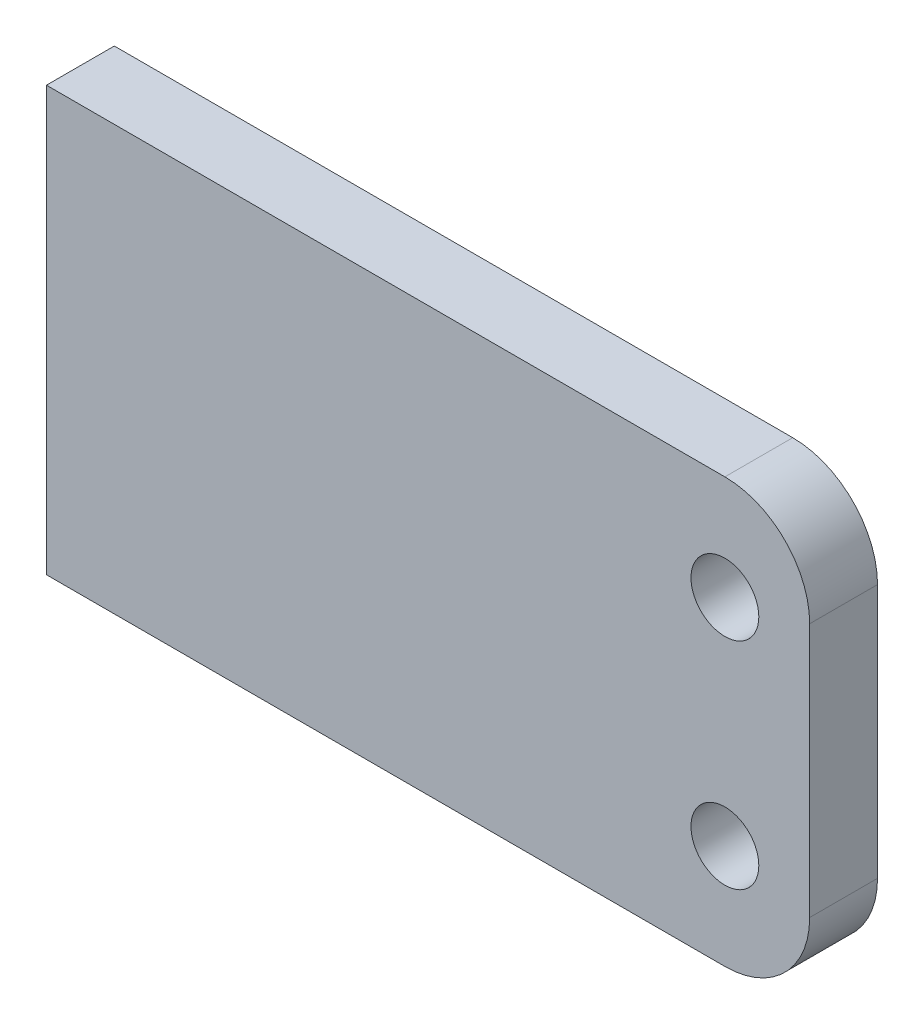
ISO-10303-21;
HEADER;
FILE_DESCRIPTION(('STEP AP214'),'2;1');
FILE_NAME('part.step','',(''),(''),'','','');
FILE_SCHEMA(('AUTOMOTIVE_DESIGN { 1 0 10303 214 1 1 1 1 }'));
ENDSEC;
DATA;
#1=APPLICATION_CONTEXT('core data for automotive mechanical design processes');
#2=APPLICATION_PROTOCOL_DEFINITION('international standard','automotive_design',2000,#1);
#3=PRODUCT_CONTEXT('',#1,'mechanical');
#4=PRODUCT('Part','Part','',(#3));
#5=PRODUCT_RELATED_PRODUCT_CATEGORY('part','',(#4));
#6=PRODUCT_DEFINITION_FORMATION('','',#4);
#7=PRODUCT_DEFINITION_CONTEXT('part definition',#1,'design');
#8=PRODUCT_DEFINITION('design','',#6,#7);
#9=PRODUCT_DEFINITION_SHAPE('','',#8);
#10=(LENGTH_UNIT() NAMED_UNIT(*) SI_UNIT(.MILLI.,.METRE.));
#11=(NAMED_UNIT(*) PLANE_ANGLE_UNIT() SI_UNIT($,.RADIAN.));
#12=(NAMED_UNIT(*) SI_UNIT($,.STERADIAN.) SOLID_ANGLE_UNIT());
#13=UNCERTAINTY_MEASURE_WITH_UNIT(LENGTH_MEASURE(1.E-05),#10,'distance_accuracy_value','');
#14=(GEOMETRIC_REPRESENTATION_CONTEXT(3) GLOBAL_UNCERTAINTY_ASSIGNED_CONTEXT((#13)) GLOBAL_UNIT_ASSIGNED_CONTEXT((#10,
#11,#12)) REPRESENTATION_CONTEXT('',''));
#15=CARTESIAN_POINT('',(0.,0.,0.));
#16=DIRECTION('',(0.,0.,1.));
#17=DIRECTION('',(1.,0.,0.));
#18=AXIS2_PLACEMENT_3D('',#15,#16,#17);
#19=CARTESIAN_POINT('',(80.,-40.,8.));
#20=DIRECTION('',(0.,0.,1.));
#21=DIRECTION('',(1.,0.,0.));
#22=AXIS2_PLACEMENT_3D('',#19,#20,#21);
#23=PLANE('',#22);
#24=CARTESIAN_POINT('',(80.,-12.3,8.));
#25=DIRECTION('',(0.,0.,1.));
#26=DIRECTION('',(1.,0.,0.));
#27=AXIS2_PLACEMENT_3D('',#24,#25,#26);
#28=CIRCLE('',#27,4.00000000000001);
#29=CARTESIAN_POINT('',(84.,-12.3,8.));
#30=VERTEX_POINT('',#29);
#31=EDGE_CURVE('E103',#30,#30,#28,.T.);
#32=ORIENTED_EDGE('',*,*,#31,.F.);
#33=EDGE_LOOP('',(#32));
#34=FACE_BOUND('',#33,.T.);
#35=DIRECTION('',(0.,-1.,0.));
#36=VECTOR('',#35,1.);
#37=CARTESIAN_POINT('',(0.,0.,8.));
#38=LINE('',#37,#36);
#39=CARTESIAN_POINT('',(0.,0.,8.));
#40=VERTEX_POINT('',#39);
#41=CARTESIAN_POINT('',(0.,-50.,8.));
#42=VERTEX_POINT('',#41);
#43=EDGE_CURVE('E117',#40,#42,#38,.T.);
#44=ORIENTED_EDGE('',*,*,#43,.T.);
#45=DIRECTION('',(1.,0.,0.));
#46=VECTOR('',#45,1.);
#47=CARTESIAN_POINT('',(0.,-50.,8.));
#48=LINE('',#47,#46);
#49=CARTESIAN_POINT('',(79.9999999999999,-50.,8.));
#50=VERTEX_POINT('',#49);
#51=EDGE_CURVE('E98',#42,#50,#48,.T.);
#52=ORIENTED_EDGE('',*,*,#51,.T.);
#53=CARTESIAN_POINT('',(80.,-40.,8.));
#54=DIRECTION('',(0.,0.,1.));
#55=DIRECTION('',(1.,0.,0.));
#56=AXIS2_PLACEMENT_3D('',#53,#54,#55);
#57=CIRCLE('',#56,10.);
#58=CARTESIAN_POINT('',(90.,-39.9999999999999,8.));
#59=VERTEX_POINT('',#58);
#60=EDGE_CURVE('E120',#50,#59,#57,.T.);
#61=ORIENTED_EDGE('',*,*,#60,.T.);
#62=DIRECTION('',(0.,1.,0.));
#63=VECTOR('',#62,1.);
#64=CARTESIAN_POINT('',(90.,-10.0000000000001,8.));
#65=LINE('',#64,#63);
#66=CARTESIAN_POINT('',(90.,-10.0000000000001,8.));
#67=VERTEX_POINT('',#66);
#68=EDGE_CURVE('E122',#59,#67,#65,.T.);
#69=ORIENTED_EDGE('',*,*,#68,.T.);
#70=CARTESIAN_POINT('',(80.,-9.99999999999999,8.));
#71=DIRECTION('',(0.,0.,1.));
#72=DIRECTION('',(1.,0.,0.));
#73=AXIS2_PLACEMENT_3D('',#70,#71,#72);
#74=CIRCLE('',#73,10.);
#75=CARTESIAN_POINT('',(79.9999999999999,0.,8.));
#76=VERTEX_POINT('',#75);
#77=EDGE_CURVE('E51',#67,#76,#74,.T.);
#78=ORIENTED_EDGE('',*,*,#77,.T.);
#79=DIRECTION('',(-1.,0.,0.));
#80=VECTOR('',#79,1.);
#81=CARTESIAN_POINT('',(0.,0.,8.));
#82=LINE('',#81,#80);
#83=EDGE_CURVE('E46',#76,#40,#82,.T.);
#84=ORIENTED_EDGE('',*,*,#83,.T.);
#85=EDGE_LOOP('',(#44,#52,#61,#69,#78,#84));
#86=FACE_BOUND('',#85,.T.);
#87=CARTESIAN_POINT('',(80.,-37.7,8.));
#88=DIRECTION('',(0.,0.,1.));
#89=DIRECTION('',(1.,0.,0.));
#90=AXIS2_PLACEMENT_3D('',#87,#88,#89);
#91=CIRCLE('',#90,4.00000000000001);
#92=CARTESIAN_POINT('',(84.,-37.7,8.));
#93=VERTEX_POINT('',#92);
#94=EDGE_CURVE('E177',#93,#93,#91,.T.);
#95=ORIENTED_EDGE('',*,*,#94,.F.);
#96=EDGE_LOOP('',(#95));
#97=FACE_BOUND('',#96,.T.);
#98=ADVANCED_FACE('F31',(#34,#86,#97),#23,.T.);
#99=CARTESIAN_POINT('',(80.,-40.,0.));
#100=DIRECTION('',(0.,0.,1.));
#101=DIRECTION('',(1.,0.,0.));
#102=AXIS2_PLACEMENT_3D('',#99,#100,#101);
#103=PLANE('',#102);
#104=CARTESIAN_POINT('',(80.,-12.3,0.));
#105=DIRECTION('',(0.,0.,1.));
#106=DIRECTION('',(1.,0.,0.));
#107=AXIS2_PLACEMENT_3D('',#104,#105,#106);
#108=CIRCLE('',#107,4.00000000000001);
#109=CARTESIAN_POINT('',(84.,-12.3,0.));
#110=VERTEX_POINT('',#109);
#111=EDGE_CURVE('E106',#110,#110,#108,.T.);
#112=ORIENTED_EDGE('',*,*,#111,.T.);
#113=EDGE_LOOP('',(#112));
#114=FACE_BOUND('',#113,.T.);
#115=DIRECTION('',(0.,-1.,0.));
#116=VECTOR('',#115,1.);
#117=CARTESIAN_POINT('',(0.,0.,0.));
#118=LINE('',#117,#116);
#119=CARTESIAN_POINT('',(0.,0.,0.));
#120=VERTEX_POINT('',#119);
#121=CARTESIAN_POINT('',(0.,-50.,0.));
#122=VERTEX_POINT('',#121);
#123=EDGE_CURVE('E89',#120,#122,#118,.T.);
#124=ORIENTED_EDGE('',*,*,#123,.F.);
#125=DIRECTION('',(-1.,0.,0.));
#126=VECTOR('',#125,1.);
#127=CARTESIAN_POINT('',(0.,0.,0.));
#128=LINE('',#127,#126);
#129=CARTESIAN_POINT('',(79.9999999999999,0.,0.));
#130=VERTEX_POINT('',#129);
#131=EDGE_CURVE('E115',#130,#120,#128,.T.);
#132=ORIENTED_EDGE('',*,*,#131,.F.);
#133=CARTESIAN_POINT('',(80.,-9.99999999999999,0.));
#134=DIRECTION('',(0.,0.,1.));
#135=DIRECTION('',(1.,0.,0.));
#136=AXIS2_PLACEMENT_3D('',#133,#134,#135);
#137=CIRCLE('',#136,10.);
#138=CARTESIAN_POINT('',(90.,-10.0000000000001,0.));
#139=VERTEX_POINT('',#138);
#140=EDGE_CURVE('E113',#139,#130,#137,.T.);
#141=ORIENTED_EDGE('',*,*,#140,.F.);
#142=DIRECTION('',(0.,1.,0.));
#143=VECTOR('',#142,1.);
#144=CARTESIAN_POINT('',(90.,-10.0000000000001,0.));
#145=LINE('',#144,#143);
#146=CARTESIAN_POINT('',(90.,-39.9999999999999,0.));
#147=VERTEX_POINT('',#146);
#148=EDGE_CURVE('E111',#147,#139,#145,.T.);
#149=ORIENTED_EDGE('',*,*,#148,.F.);
#150=CARTESIAN_POINT('',(80.,-40.,0.));
#151=DIRECTION('',(0.,0.,1.));
#152=DIRECTION('',(1.,0.,0.));
#153=AXIS2_PLACEMENT_3D('',#150,#151,#152);
#154=CIRCLE('',#153,10.);
#155=CARTESIAN_POINT('',(79.9999999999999,-50.,0.));
#156=VERTEX_POINT('',#155);
#157=EDGE_CURVE('E91',#156,#147,#154,.T.);
#158=ORIENTED_EDGE('',*,*,#157,.F.);
#159=DIRECTION('',(1.,0.,0.));
#160=VECTOR('',#159,1.);
#161=CARTESIAN_POINT('',(0.,-50.,0.));
#162=LINE('',#161,#160);
#163=EDGE_CURVE('E84',#122,#156,#162,.T.);
#164=ORIENTED_EDGE('',*,*,#163,.F.);
#165=EDGE_LOOP('',(#124,#132,#141,#149,#158,#164));
#166=FACE_BOUND('',#165,.T.);
#167=CARTESIAN_POINT('',(80.,-37.7,0.));
#168=DIRECTION('',(0.,0.,1.));
#169=DIRECTION('',(1.,0.,0.));
#170=AXIS2_PLACEMENT_3D('',#167,#168,#169);
#171=CIRCLE('',#170,4.00000000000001);
#172=CARTESIAN_POINT('',(84.,-37.7,0.));
#173=VERTEX_POINT('',#172);
#174=EDGE_CURVE('E180',#173,#173,#171,.T.);
#175=ORIENTED_EDGE('',*,*,#174,.T.);
#176=EDGE_LOOP('',(#175));
#177=FACE_BOUND('',#176,.T.);
#178=ADVANCED_FACE('F85',(#114,#166,#177),#103,.F.);
#179=CARTESIAN_POINT('',(0.,0.,8.));
#180=DIRECTION('',(1.,0.,0.));
#181=DIRECTION('',(0.,1.,0.));
#182=AXIS2_PLACEMENT_3D('',#179,#180,#181);
#183=PLANE('',#182);
#184=ORIENTED_EDGE('',*,*,#123,.T.);
#185=DIRECTION('',(0.,0.,-1.));
#186=VECTOR('',#185,1.);
#187=CARTESIAN_POINT('',(0.,-50.,8.));
#188=LINE('',#187,#186);
#189=EDGE_CURVE('E11',#42,#122,#188,.T.);
#190=ORIENTED_EDGE('',*,*,#189,.F.);
#191=ORIENTED_EDGE('',*,*,#43,.F.);
#192=DIRECTION('',(0.,0.,-1.));
#193=VECTOR('',#192,1.);
#194=CARTESIAN_POINT('',(0.,0.,8.));
#195=LINE('',#194,#193);
#196=EDGE_CURVE('E102',#40,#120,#195,.T.);
#197=ORIENTED_EDGE('',*,*,#196,.T.);
#198=EDGE_LOOP('',(#184,#190,#191,#197));
#199=FACE_BOUND('',#198,.T.);
#200=ADVANCED_FACE('F33',(#199),#183,.F.);
#201=CARTESIAN_POINT('',(0.,-50.,8.));
#202=DIRECTION('',(0.,1.,0.));
#203=DIRECTION('',(0.,0.,1.));
#204=AXIS2_PLACEMENT_3D('',#201,#202,#203);
#205=PLANE('',#204);
#206=ORIENTED_EDGE('',*,*,#163,.T.);
#207=DIRECTION('',(0.,0.,-1.));
#208=VECTOR('',#207,1.);
#209=CARTESIAN_POINT('',(79.9999999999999,-50.,8.));
#210=LINE('',#209,#208);
#211=EDGE_CURVE('E39',#50,#156,#210,.T.);
#212=ORIENTED_EDGE('',*,*,#211,.F.);
#213=ORIENTED_EDGE('',*,*,#51,.F.);
#214=ORIENTED_EDGE('',*,*,#189,.T.);
#215=EDGE_LOOP('',(#206,#212,#213,#214));
#216=FACE_BOUND('',#215,.T.);
#217=ADVANCED_FACE('F97',(#216),#205,.F.);
#218=CARTESIAN_POINT('',(80.,-40.,8.));
#219=DIRECTION('',(0.,0.,-1.));
#220=DIRECTION('',(-1.,0.,0.));
#221=AXIS2_PLACEMENT_3D('',#218,#219,#220);
#222=CYLINDRICAL_SURFACE('',#221,10.);
#223=ORIENTED_EDGE('',*,*,#157,.T.);
#224=DIRECTION('',(0.,0.,-1.));
#225=VECTOR('',#224,1.);
#226=CARTESIAN_POINT('',(90.,-39.9999999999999,8.));
#227=LINE('',#226,#225);
#228=EDGE_CURVE('E133',#59,#147,#227,.T.);
#229=ORIENTED_EDGE('',*,*,#228,.F.);
#230=ORIENTED_EDGE('',*,*,#60,.F.);
#231=ORIENTED_EDGE('',*,*,#211,.T.);
#232=EDGE_LOOP('',(#223,#229,#230,#231));
#233=FACE_BOUND('',#232,.T.);
#234=ADVANCED_FACE('F137',(#233),#222,.T.);
#235=CARTESIAN_POINT('',(90.,-10.0000000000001,8.));
#236=DIRECTION('',(-1.,0.,0.));
#237=DIRECTION('',(0.,0.,1.));
#238=AXIS2_PLACEMENT_3D('',#235,#236,#237);
#239=PLANE('',#238);
#240=ORIENTED_EDGE('',*,*,#148,.T.);
#241=DIRECTION('',(0.,0.,-1.));
#242=VECTOR('',#241,1.);
#243=CARTESIAN_POINT('',(90.,-10.0000000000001,8.));
#244=LINE('',#243,#242);
#245=EDGE_CURVE('E130',#67,#139,#244,.T.);
#246=ORIENTED_EDGE('',*,*,#245,.F.);
#247=ORIENTED_EDGE('',*,*,#68,.F.);
#248=ORIENTED_EDGE('',*,*,#228,.T.);
#249=EDGE_LOOP('',(#240,#246,#247,#248));
#250=FACE_BOUND('',#249,.T.);
#251=ADVANCED_FACE('F143',(#250),#239,.F.);
#252=CARTESIAN_POINT('',(80.,-9.99999999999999,8.));
#253=DIRECTION('',(0.,0.,-1.));
#254=DIRECTION('',(-1.,0.,0.));
#255=AXIS2_PLACEMENT_3D('',#252,#253,#254);
#256=CYLINDRICAL_SURFACE('',#255,10.);
#257=ORIENTED_EDGE('',*,*,#140,.T.);
#258=DIRECTION('',(0.,0.,-1.));
#259=VECTOR('',#258,1.);
#260=CARTESIAN_POINT('',(79.9999999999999,0.,8.));
#261=LINE('',#260,#259);
#262=EDGE_CURVE('E127',#76,#130,#261,.T.);
#263=ORIENTED_EDGE('',*,*,#262,.F.);
#264=ORIENTED_EDGE('',*,*,#77,.F.);
#265=ORIENTED_EDGE('',*,*,#245,.T.);
#266=EDGE_LOOP('',(#257,#263,#264,#265));
#267=FACE_BOUND('',#266,.T.);
#268=ADVANCED_FACE('F146',(#267),#256,.T.);
#269=CARTESIAN_POINT('',(0.,0.,8.));
#270=DIRECTION('',(0.,-1.,0.));
#271=DIRECTION('',(0.,0.,-1.));
#272=AXIS2_PLACEMENT_3D('',#269,#270,#271);
#273=PLANE('',#272);
#274=ORIENTED_EDGE('',*,*,#131,.T.);
#275=ORIENTED_EDGE('',*,*,#196,.F.);
#276=ORIENTED_EDGE('',*,*,#83,.F.);
#277=ORIENTED_EDGE('',*,*,#262,.T.);
#278=EDGE_LOOP('',(#274,#275,#276,#277));
#279=FACE_BOUND('',#278,.T.);
#280=ADVANCED_FACE('F148',(#279),#273,.F.);
#281=CARTESIAN_POINT('',(80.,-12.3,8.));
#282=DIRECTION('',(0.,0.,-1.));
#283=DIRECTION('',(-1.,0.,0.));
#284=AXIS2_PLACEMENT_3D('',#281,#282,#283);
#285=CYLINDRICAL_SURFACE('',#284,4.00000000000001);
#286=ORIENTED_EDGE('',*,*,#31,.T.);
#287=EDGE_LOOP('',(#286));
#288=FACE_BOUND('',#287,.T.);
#289=ORIENTED_EDGE('',*,*,#111,.F.);
#290=EDGE_LOOP('',(#289));
#291=FACE_BOUND('',#290,.T.);
#292=ADVANCED_FACE('F150',(#288,#291),#285,.F.);
#293=CARTESIAN_POINT('',(80.,-37.7,8.));
#294=DIRECTION('',(0.,0.,-1.));
#295=DIRECTION('',(-1.,0.,0.));
#296=AXIS2_PLACEMENT_3D('',#293,#294,#295);
#297=CYLINDRICAL_SURFACE('',#296,4.00000000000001);
#298=ORIENTED_EDGE('',*,*,#94,.T.);
#299=EDGE_LOOP('',(#298));
#300=FACE_BOUND('',#299,.T.);
#301=ORIENTED_EDGE('',*,*,#174,.F.);
#302=EDGE_LOOP('',(#301));
#303=FACE_BOUND('',#302,.T.);
#304=ADVANCED_FACE('F156',(#300,#303),#297,.F.);
#305=CLOSED_SHELL('',(#98,#178,#200,#217,#234,#251,#268,#280,#292,#304));
#306=MANIFOLD_SOLID_BREP('B2',#305);
#307=ADVANCED_BREP_SHAPE_REPRESENTATION('',(#18,#306),#14);
#308=SHAPE_DEFINITION_REPRESENTATION(#9,#307);
ENDSEC;
END-ISO-10303-21;
